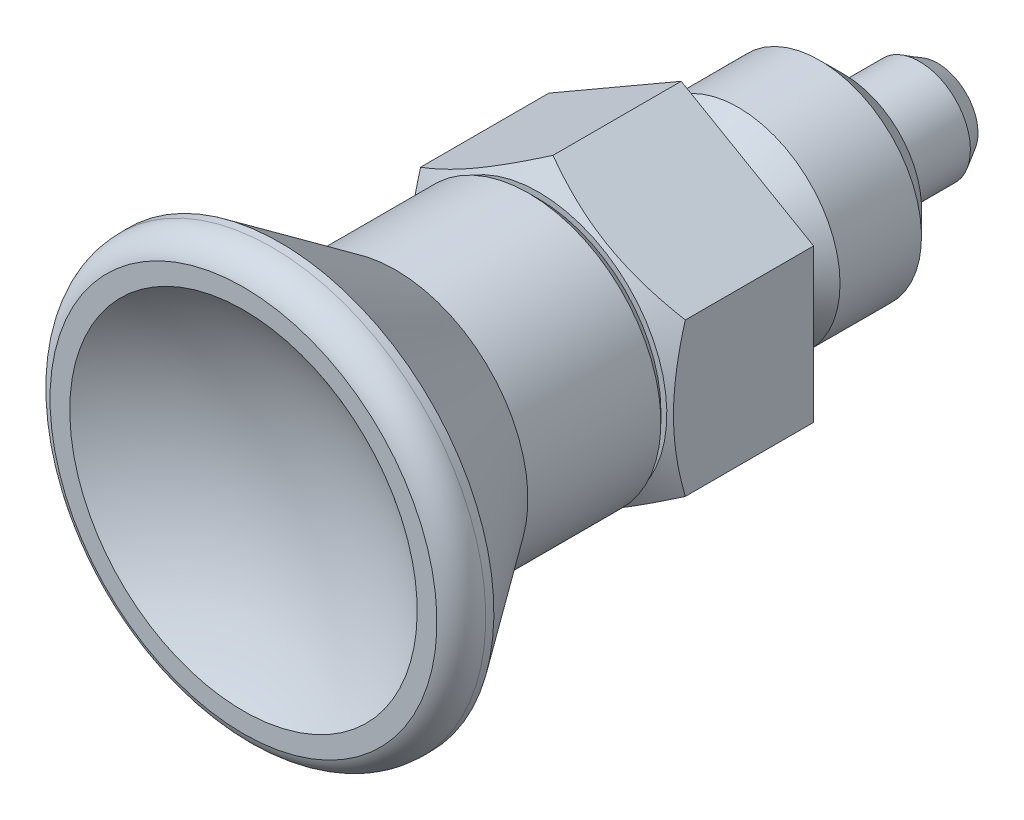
ISO-10303-21;
HEADER;
FILE_DESCRIPTION(('STEP AP214'),'2;1');
FILE_NAME('part.step','',(''),(''),'','','');
FILE_SCHEMA(('AUTOMOTIVE_DESIGN { 1 0 10303 214 1 1 1 1 }'));
ENDSEC;
DATA;
#1=APPLICATION_CONTEXT('core data for automotive mechanical design processes');
#2=APPLICATION_PROTOCOL_DEFINITION('international standard','automotive_design',2000,#1);
#3=PRODUCT_CONTEXT('',#1,'mechanical');
#4=PRODUCT('Part','Part','',(#3));
#5=PRODUCT_RELATED_PRODUCT_CATEGORY('part','',(#4));
#6=PRODUCT_DEFINITION_FORMATION('','',#4);
#7=PRODUCT_DEFINITION_CONTEXT('part definition',#1,'design');
#8=PRODUCT_DEFINITION('design','',#6,#7);
#9=PRODUCT_DEFINITION_SHAPE('','',#8);
#10=(LENGTH_UNIT() NAMED_UNIT(*) SI_UNIT(.MILLI.,.METRE.));
#11=(NAMED_UNIT(*) PLANE_ANGLE_UNIT() SI_UNIT($,.RADIAN.));
#12=(NAMED_UNIT(*) SI_UNIT($,.STERADIAN.) SOLID_ANGLE_UNIT());
#13=UNCERTAINTY_MEASURE_WITH_UNIT(LENGTH_MEASURE(1.E-05),#10,'distance_accuracy_value','');
#14=(GEOMETRIC_REPRESENTATION_CONTEXT(3) GLOBAL_UNCERTAINTY_ASSIGNED_CONTEXT((#13)) GLOBAL_UNIT_ASSIGNED_CONTEXT((#10,
#11,#12)) REPRESENTATION_CONTEXT('',''));
#15=CARTESIAN_POINT('',(0.,0.,0.));
#16=DIRECTION('',(0.,0.,1.));
#17=DIRECTION('',(1.,0.,0.));
#18=AXIS2_PLACEMENT_3D('',#15,#16,#17);
#19=CARTESIAN_POINT('',(0.,0.,-8.0000000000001));
#20=DIRECTION('',(-1.,0.,0.));
#21=DIRECTION('',(0.,1.,0.));
#22=AXIS2_PLACEMENT_3D('',#19,#20,#21);
#23=SPHERICAL_SURFACE('',#22,4.99999999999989);
#24=CARTESIAN_POINT('',(0.,0.,-12.5881225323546));
#25=DIRECTION('',(0.,0.,1.));
#26=DIRECTION('',(0.,-1.,0.));
#27=AXIS2_PLACEMENT_3D('',#24,#25,#26);
#28=CIRCLE('',#27,1.98724221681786);
#29=CARTESIAN_POINT('',(0.,-1.98724221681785,-12.5881225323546));
#30=VERTEX_POINT('',#29);
#31=EDGE_CURVE('E18',#30,#30,#28,.T.);
#32=ORIENTED_EDGE('',*,*,#31,.F.);
#33=EDGE_LOOP('',(#32));
#34=FACE_BOUND('',#33,.T.);
#35=ADVANCED_FACE('F14',(#34),#23,.T.);
#36=CARTESIAN_POINT('',(0.,0.,-11.7000000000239));
#37=DIRECTION('',(0.,0.,1.));
#38=DIRECTION('',(0.,-1.,0.));
#39=AXIS2_PLACEMENT_3D('',#36,#37,#38);
#40=CONICAL_SURFACE('',#39,2.49999999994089,0.523598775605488);
#41=CARTESIAN_POINT('',(0.,0.,-11.7));
#42=DIRECTION('',(0.,0.,1.));
#43=DIRECTION('',(0.,-1.,0.));
#44=AXIS2_PLACEMENT_3D('',#41,#42,#43);
#45=CIRCLE('',#44,2.5);
#46=CARTESIAN_POINT('',(0.,-2.5,-11.7));
#47=VERTEX_POINT('',#46);
#48=EDGE_CURVE('E266',#47,#47,#45,.T.);
#49=ORIENTED_EDGE('',*,*,#48,.F.);
#50=EDGE_LOOP('',(#49));
#51=FACE_BOUND('',#50,.T.);
#52=ORIENTED_EDGE('',*,*,#31,.T.);
#53=EDGE_LOOP('',(#52));
#54=FACE_BOUND('',#53,.T.);
#55=ADVANCED_FACE('F177',(#51,#54),#40,.T.);
#56=CARTESIAN_POINT('',(0.,0.,-13.));
#57=DIRECTION('',(0.,0.,1.));
#58=DIRECTION('',(0.,-1.,0.));
#59=AXIS2_PLACEMENT_3D('',#56,#57,#58);
#60=CYLINDRICAL_SURFACE('',#59,2.5);
#61=CARTESIAN_POINT('',(0.,0.,-8.));
#62=DIRECTION('',(0.,0.,1.));
#63=DIRECTION('',(0.,-1.,0.));
#64=AXIS2_PLACEMENT_3D('',#61,#62,#63);
#65=CIRCLE('',#64,2.5);
#66=CARTESIAN_POINT('',(0.,-2.5,-8.));
#67=VERTEX_POINT('',#66);
#68=EDGE_CURVE('E269',#67,#67,#65,.F.);
#69=ORIENTED_EDGE('',*,*,#68,.T.);
#70=EDGE_LOOP('',(#69));
#71=FACE_BOUND('',#70,.T.);
#72=ORIENTED_EDGE('',*,*,#48,.T.);
#73=EDGE_LOOP('',(#72));
#74=FACE_BOUND('',#73,.T.);
#75=ADVANCED_FACE('F174',(#71,#74),#60,.T.);
#76=CARTESIAN_POINT('',(3.8,0.,-8.));
#77=DIRECTION('',(0.,0.,1.));
#78=DIRECTION('',(0.,-1.,0.));
#79=AXIS2_PLACEMENT_3D('',#76,#77,#78);
#80=PLANE('',#79);
#81=CARTESIAN_POINT('',(0.,0.,-8.0000000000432));
#82=DIRECTION('',(0.,0.,1.));
#83=DIRECTION('',(-1.,0.,0.));
#84=AXIS2_PLACEMENT_3D('',#81,#82,#83);
#85=CIRCLE('',#84,3.79999999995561);
#86=CARTESIAN_POINT('',(-3.79999999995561,0.,-8.0000000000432));
#87=VERTEX_POINT('',#86);
#88=EDGE_CURVE('E276',#87,#87,#85,.T.);
#89=ORIENTED_EDGE('',*,*,#88,.F.);
#90=EDGE_LOOP('',(#89));
#91=FACE_BOUND('',#90,.T.);
#92=ORIENTED_EDGE('',*,*,#68,.F.);
#93=EDGE_LOOP('',(#92));
#94=FACE_BOUND('',#93,.T.);
#95=ADVANCED_FACE('F170',(#91,#94),#80,.F.);
#96=CARTESIAN_POINT('',(0.,0.,-6.80000000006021));
#97=DIRECTION('',(0.,0.,1.));
#98=DIRECTION('',(-1.,0.,0.));
#99=AXIS2_PLACEMENT_3D('',#96,#97,#98);
#100=CONICAL_SURFACE('',#99,4.99999999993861,0.785398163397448);
#101=CARTESIAN_POINT('',(0.,0.,-6.8));
#102=DIRECTION('',(0.,0.,1.));
#103=DIRECTION('',(0.,-1.,0.));
#104=AXIS2_PLACEMENT_3D('',#101,#102,#103);
#105=CIRCLE('',#104,5.);
#106=CARTESIAN_POINT('',(0.,-5.,-6.8));
#107=VERTEX_POINT('',#106);
#108=EDGE_CURVE('E272',#107,#107,#105,.T.);
#109=ORIENTED_EDGE('',*,*,#108,.F.);
#110=EDGE_LOOP('',(#109));
#111=FACE_BOUND('',#110,.T.);
#112=ORIENTED_EDGE('',*,*,#88,.T.);
#113=EDGE_LOOP('',(#112));
#114=FACE_BOUND('',#113,.T.);
#115=ADVANCED_FACE('F166',(#111,#114),#100,.T.);
#116=CARTESIAN_POINT('',(0.,0.,-8.));
#117=DIRECTION('',(0.,0.,1.));
#118=DIRECTION('',(0.,-1.,0.));
#119=AXIS2_PLACEMENT_3D('',#116,#117,#118);
#120=CYLINDRICAL_SURFACE('',#119,5.);
#121=CARTESIAN_POINT('',(0.,0.,-2.79999999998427));
#122=DIRECTION('',(0.,0.,-1.));
#123=DIRECTION('',(0.,1.,0.));
#124=AXIS2_PLACEMENT_3D('',#121,#122,#123);
#125=CIRCLE('',#124,4.99999999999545);
#126=CARTESIAN_POINT('',(0.,4.99999999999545,-2.79999999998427));
#127=VERTEX_POINT('',#126);
#128=EDGE_CURVE('E275',#127,#127,#125,.F.);
#129=ORIENTED_EDGE('',*,*,#128,.F.);
#130=EDGE_LOOP('',(#129));
#131=FACE_BOUND('',#130,.T.);
#132=ORIENTED_EDGE('',*,*,#108,.T.);
#133=EDGE_LOOP('',(#132));
#134=FACE_BOUND('',#133,.T.);
#135=ADVANCED_FACE('F162',(#131,#134),#120,.T.);
#136=CARTESIAN_POINT('',(0.,0.,-2.79999999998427));
#137=DIRECTION('',(0.,0.,-1.));
#138=DIRECTION('',(0.,1.,0.));
#139=AXIS2_PLACEMENT_3D('',#136,#137,#138);
#140=CONICAL_SURFACE('',#139,4.99999999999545,0.698131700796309);
#141=CARTESIAN_POINT('',(0.,0.,-1.29883539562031));
#142=DIRECTION('',(0.,0.,-1.));
#143=DIRECTION('',(0.,1.,0.));
#144=AXIS2_PLACEMENT_3D('',#141,#142,#143);
#145=CIRCLE('',#144,3.74037333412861);
#146=CARTESIAN_POINT('',(0.,3.74037333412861,-1.29883539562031));
#147=VERTEX_POINT('',#146);
#148=EDGE_CURVE('E149',#147,#147,#145,.T.);
#149=ORIENTED_EDGE('',*,*,#148,.T.);
#150=EDGE_LOOP('',(#149));
#151=FACE_BOUND('',#150,.T.);
#152=ORIENTED_EDGE('',*,*,#128,.T.);
#153=EDGE_LOOP('',(#152));
#154=FACE_BOUND('',#153,.T.);
#155=ADVANCED_FACE('F158',(#151,#154),#140,.T.);
#156=CARTESIAN_POINT('',(0.,0.,-0.91316282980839));
#157=DIRECTION('',(0.,0.,-1.));
#158=DIRECTION('',(0.,1.,0.));
#159=AXIS2_PLACEMENT_3D('',#156,#157,#158);
#160=TOROIDAL_SURFACE('',#159,4.2,0.6);
#161=CARTESIAN_POINT('',(0.,0.,-0.91316282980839));
#162=DIRECTION('',(0.,0.,1.));
#163=DIRECTION('',(0.,-1.,0.));
#164=AXIS2_PLACEMENT_3D('',#161,#162,#163);
#165=CIRCLE('',#164,3.6);
#166=CARTESIAN_POINT('',(0.,-3.6,-0.91316282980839));
#167=VERTEX_POINT('',#166);
#168=EDGE_CURVE('E136',#167,#167,#165,.T.);
#169=ORIENTED_EDGE('',*,*,#168,.F.);
#170=EDGE_LOOP('',(#169));
#171=FACE_BOUND('',#170,.T.);
#172=ORIENTED_EDGE('',*,*,#148,.F.);
#173=EDGE_LOOP('',(#172));
#174=FACE_BOUND('',#173,.T.);
#175=ADVANCED_FACE('F155',(#171,#174),#160,.F.);
#176=CARTESIAN_POINT('',(0.,0.,-8.));
#177=DIRECTION('',(0.,0.,1.));
#178=DIRECTION('',(0.,-1.,0.));
#179=AXIS2_PLACEMENT_3D('',#176,#177,#178);
#180=CYLINDRICAL_SURFACE('',#179,3.6);
#181=CARTESIAN_POINT('',(0.,0.,-0.6));
#182=DIRECTION('',(0.,0.,-1.));
#183=DIRECTION('',(0.,1.,0.));
#184=AXIS2_PLACEMENT_3D('',#181,#182,#183);
#185=CIRCLE('',#184,3.6);
#186=CARTESIAN_POINT('',(0.,3.6,-0.6));
#187=VERTEX_POINT('',#186);
#188=EDGE_CURVE('E133',#187,#187,#185,.T.);
#189=ORIENTED_EDGE('',*,*,#188,.T.);
#190=EDGE_LOOP('',(#189));
#191=FACE_BOUND('',#190,.T.);
#192=ORIENTED_EDGE('',*,*,#168,.T.);
#193=EDGE_LOOP('',(#192));
#194=FACE_BOUND('',#193,.T.);
#195=ADVANCED_FACE('F126',(#191,#194),#180,.T.);
#196=CARTESIAN_POINT('',(0.,0.,-0.6));
#197=DIRECTION('',(0.,0.,-1.));
#198=DIRECTION('',(0.,1.,0.));
#199=AXIS2_PLACEMENT_3D('',#196,#197,#198);
#200=TOROIDAL_SURFACE('',#199,4.2,0.6);
#201=CARTESIAN_POINT('',(0.,0.,0.));
#202=DIRECTION('',(0.,0.,-1.));
#203=DIRECTION('',(0.,1.,0.));
#204=AXIS2_PLACEMENT_3D('',#201,#202,#203);
#205=CIRCLE('',#204,4.2);
#206=CARTESIAN_POINT('',(0.,4.2,0.));
#207=VERTEX_POINT('',#206);
#208=EDGE_CURVE('E81',#207,#207,#205,.T.);
#209=ORIENTED_EDGE('',*,*,#208,.T.);
#210=EDGE_LOOP('',(#209));
#211=FACE_BOUND('',#210,.T.);
#212=ORIENTED_EDGE('',*,*,#188,.F.);
#213=EDGE_LOOP('',(#212));
#214=FACE_BOUND('',#213,.T.);
#215=ADVANCED_FACE('F119',(#211,#214),#200,.F.);
#216=CARTESIAN_POINT('',(18.,0.,0.));
#217=DIRECTION('',(0.,0.,1.));
#218=DIRECTION('',(0.,-1.,0.));
#219=AXIS2_PLACEMENT_3D('',#216,#217,#218);
#220=PLANE('',#219);
#221=DIRECTION('',(-0.866025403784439,0.5,0.));
#222=VECTOR('',#221,1.);
#223=CARTESIAN_POINT('',(6.5,3.75277674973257,0.));
#224=LINE('',#223,#222);
#225=CARTESIAN_POINT('',(6.5,3.75277674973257,0.));
#226=VERTEX_POINT('',#225);
#227=CARTESIAN_POINT('',(0.,7.50555349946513,0.));
#228=VERTEX_POINT('',#227);
#229=EDGE_CURVE('E88',#226,#228,#224,.T.);
#230=ORIENTED_EDGE('',*,*,#229,.F.);
#231=DIRECTION('',(0.,1.,0.));
#232=VECTOR('',#231,1.);
#233=CARTESIAN_POINT('',(6.5,-3.75277674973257,0.));
#234=LINE('',#233,#232);
#235=CARTESIAN_POINT('',(6.5,-3.75277674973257,0.));
#236=VERTEX_POINT('',#235);
#237=EDGE_CURVE('E84',#236,#226,#234,.T.);
#238=ORIENTED_EDGE('',*,*,#237,.F.);
#239=DIRECTION('',(0.866025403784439,0.5,0.));
#240=VECTOR('',#239,1.);
#241=CARTESIAN_POINT('',(0.,-7.50555349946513,0.));
#242=LINE('',#241,#240);
#243=CARTESIAN_POINT('',(0.,-7.50555349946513,0.));
#244=VERTEX_POINT('',#243);
#245=EDGE_CURVE('E60',#244,#236,#242,.T.);
#246=ORIENTED_EDGE('',*,*,#245,.F.);
#247=DIRECTION('',(0.866025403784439,-0.5,0.));
#248=VECTOR('',#247,1.);
#249=CARTESIAN_POINT('',(-6.5,-3.75277674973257,0.));
#250=LINE('',#249,#248);
#251=CARTESIAN_POINT('',(-6.5,-3.75277674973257,0.));
#252=VERTEX_POINT('',#251);
#253=EDGE_CURVE('E100',#252,#244,#250,.T.);
#254=ORIENTED_EDGE('',*,*,#253,.F.);
#255=DIRECTION('',(0.,-1.,0.));
#256=VECTOR('',#255,1.);
#257=CARTESIAN_POINT('',(-6.5,3.75277674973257,0.));
#258=LINE('',#257,#256);
#259=CARTESIAN_POINT('',(-6.5,3.75277674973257,0.));
#260=VERTEX_POINT('',#259);
#261=EDGE_CURVE('E65',#260,#252,#258,.T.);
#262=ORIENTED_EDGE('',*,*,#261,.F.);
#263=DIRECTION('',(-0.866025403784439,-0.5,0.));
#264=VECTOR('',#263,1.);
#265=CARTESIAN_POINT('',(0.,7.50555349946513,0.));
#266=LINE('',#265,#264);
#267=EDGE_CURVE('E353',#228,#260,#266,.T.);
#268=ORIENTED_EDGE('',*,*,#267,.F.);
#269=EDGE_LOOP('',(#230,#238,#246,#254,#262,#268));
#270=FACE_BOUND('',#269,.T.);
#271=ORIENTED_EDGE('',*,*,#208,.F.);
#272=EDGE_LOOP('',(#271));
#273=FACE_BOUND('',#272,.T.);
#274=ADVANCED_FACE('F85',(#270,#273),#220,.F.);
#275=CARTESIAN_POINT('',(0.,-7.50555349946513,0.));
#276=DIRECTION('',(0.5,-0.866025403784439,0.));
#277=DIRECTION('',(0.866025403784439,0.5,0.));
#278=AXIS2_PLACEMENT_3D('',#275,#276,#277);
#279=PLANE('',#278);
#280=ORIENTED_EDGE('',*,*,#245,.T.);
#281=DIRECTION('',(0.,0.,1.));
#282=VECTOR('',#281,1.);
#283=CARTESIAN_POINT('',(6.5,-3.75277674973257,0.));
#284=LINE('',#283,#282);
#285=CARTESIAN_POINT('',(6.5,-3.75277676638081,6.29999999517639));
#286=VERTEX_POINT('',#285);
#287=EDGE_CURVE('E77',#286,#236,#284,.F.);
#288=ORIENTED_EDGE('',*,*,#287,.F.);
#289=CARTESIAN_POINT('',(7.50268835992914E-08,-7.50555345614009,6.3000000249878));
#290=CARTESIAN_POINT('',(0.142875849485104,-7.42306408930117,6.34761609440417));
#291=CARTESIAN_POINT('',(0.286284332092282,-7.34026716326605,6.39307099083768));
#292=CARTESIAN_POINT('',(0.574265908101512,-7.17400092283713,6.47906323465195));
#293=CARTESIAN_POINT('',(0.718839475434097,-7.09053133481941,6.51959846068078));
#294=CARTESIAN_POINT('',(1.15487481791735,-6.83878621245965,6.6330289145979));
#295=CARTESIAN_POINT('',(1.44805771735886,-6.66951698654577,6.69754584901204));
#296=CARTESIAN_POINT('',(1.88680055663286,-6.41620869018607,6.77319774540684));
#297=CARTESIAN_POINT('',(2.03104970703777,-6.33292640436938,6.79474842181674));
#298=CARTESIAN_POINT('',(2.32019970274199,-6.16598557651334,6.83088489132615));
#299=CARTESIAN_POINT('',(2.4651004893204,-6.08232706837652,6.84547129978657));
#300=CARTESIAN_POINT('',(2.75515364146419,-5.914864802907,6.86730749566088));
#301=CARTESIAN_POINT('',(2.90030553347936,-5.83106131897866,6.87456560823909));
#302=CARTESIAN_POINT('',(3.19073528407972,-5.66338162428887,6.88159737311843));
#303=CARTESIAN_POINT('',(3.33601313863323,-5.57950541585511,6.88137125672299));
#304=CARTESIAN_POINT('',(3.73400213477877,-5.34972636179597,6.87046502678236));
#305=CARTESIAN_POINT('',(3.98658292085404,-5.20389877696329,6.85216555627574));
#306=CARTESIAN_POINT('',(4.49006691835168,-4.91321215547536,6.79414403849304));
#307=CARTESIAN_POINT('',(4.7409683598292,-4.76835414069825,6.75440217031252));
#308=CARTESIAN_POINT('',(5.24546515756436,-4.47708277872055,6.65506149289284));
#309=CARTESIAN_POINT('',(5.49899687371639,-4.33070617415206,6.59504189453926));
#310=CARTESIAN_POINT('',(6.00227998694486,-4.04013553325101,6.45882256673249));
#311=CARTESIAN_POINT('',(6.25203782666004,-3.89593777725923,6.38265482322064));
#312=CARTESIAN_POINT('',(6.49999992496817,-3.75277679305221,6.30000002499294));
#313=B_SPLINE_CURVE_WITH_KNOTS('',3,(#289,#290,#291,#292,#293,#294,#295,#296,#297,#298,#299,
#300,#301,#302,#303,#304,#305,#306,#307,#308,#309,#310,#311,#312),.UNSPECIFIED.,.F.,.F.,(4,2,2,
2,2,2,2,2,2,2,2,4),(0.,0.515097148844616,1.03041562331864,2.06319348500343,2.56693467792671,
3.07063135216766,3.57375516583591,4.07686343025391,4.95263079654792,5.82920909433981,
6.72522569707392,7.61948379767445),.UNSPECIFIED.);
#314=CARTESIAN_POINT('',(3.75146884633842E-08,-7.50555347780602,6.30000001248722));
#315=VERTEX_POINT('',#314);
#316=EDGE_CURVE('E52',#315,#286,#313,.T.);
#317=ORIENTED_EDGE('',*,*,#316,.F.);
#318=DIRECTION('',(0.,0.,1.));
#319=VECTOR('',#318,1.);
#320=CARTESIAN_POINT('',(0.,-7.50555349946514,0.));
#321=LINE('',#320,#319);
#322=EDGE_CURVE('E79',#244,#315,#321,.T.);
#323=ORIENTED_EDGE('',*,*,#322,.F.);
#324=EDGE_LOOP('',(#280,#288,#317,#323));
#325=FACE_BOUND('',#324,.T.);
#326=ADVANCED_FACE('F75',(#325),#279,.T.);
#327=CARTESIAN_POINT('',(6.5,-3.75277674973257,0.));
#328=DIRECTION('',(1.,0.,0.));
#329=DIRECTION('',(0.,1.,0.));
#330=AXIS2_PLACEMENT_3D('',#327,#328,#329);
#331=PLANE('',#330);
#332=ORIENTED_EDGE('',*,*,#237,.T.);
#333=DIRECTION('',(0.,0.,1.));
#334=VECTOR('',#333,1.);
#335=CARTESIAN_POINT('',(6.5,3.75277674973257,0.));
#336=LINE('',#335,#334);
#337=CARTESIAN_POINT('',(6.50000001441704,3.75277674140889,6.29999999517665));
#338=VERTEX_POINT('',#337);
#339=EDGE_CURVE('E91',#338,#226,#336,.F.);
#340=ORIENTED_EDGE('',*,*,#339,.F.);
#341=CARTESIAN_POINT('',(6.49999996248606,-3.75277677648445,6.29999996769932));
#342=CARTESIAN_POINT('',(6.49999998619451,-3.58779804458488,6.34761605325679));
#343=CARTESIAN_POINT('',(6.49999999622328,-3.42220419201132,6.39307095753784));
#344=CARTESIAN_POINT('',(6.50000000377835,-3.08967170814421,6.47906320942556));
#345=CARTESIAN_POINT('',(6.50000000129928,-2.92273252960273,6.51959843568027));
#346=CARTESIAN_POINT('',(6.49999999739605,-2.41924227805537,6.63302889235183));
#347=CARTESIAN_POINT('',(6.49999999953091,-2.08070382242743,6.69754583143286));
#348=CARTESIAN_POINT('',(6.5000000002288,-1.5740872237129,6.77319773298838));
#349=CARTESIAN_POINT('',(6.50000000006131,-1.40752265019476,6.79474841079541));
#350=CARTESIAN_POINT('',(6.4999999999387,-1.07364099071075,6.8308848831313));
#351=CARTESIAN_POINT('',(6.49999999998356,-0.906323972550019,6.84547129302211));
#352=CARTESIAN_POINT('',(6.50000000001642,-0.571399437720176,6.86730749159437));
#353=CARTESIAN_POINT('',(6.50000000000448,-0.403792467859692,6.87456560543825));
#354=CARTESIAN_POINT('',(6.49999999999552,-0.0684330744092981,6.88159737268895));
#355=CARTESIAN_POINT('',(6.4999999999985,0.0993193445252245,6.88137125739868));
#356=CARTESIAN_POINT('',(6.5000000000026,0.558877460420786,6.8704650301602));
#357=CARTESIAN_POINT('',(6.5000000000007,0.850532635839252,6.85216556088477));
#358=CARTESIAN_POINT('',(6.4999999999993,1.43190589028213,6.79414404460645));
#359=CARTESIAN_POINT('',(6.4999999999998,1.72162192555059,6.7544021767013));
#360=CARTESIAN_POINT('',(6.50000000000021,2.30416466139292,6.65506149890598));
#361=CARTESIAN_POINT('',(6.5000000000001,2.59691787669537,6.59504189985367));
#362=CARTESIAN_POINT('',(6.4999999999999,3.17805917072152,6.45882256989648));
#363=CARTESIAN_POINT('',(6.49999999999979,3.4664546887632,6.38265482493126));
#364=CARTESIAN_POINT('',(6.5,3.7527766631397,6.30000002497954));
#365=B_SPLINE_CURVE_WITH_KNOTS('',3,(#341,#342,#343,#344,#345,#346,#347,#348,#349,#350,#351,
#352,#353,#354,#355,#356,#357,#358,#359,#360,#361,#362,#363,#364),.UNSPECIFIED.,.F.,.F.,(4,2,2,
2,2,2,2,2,2,2,2,4),(0.,0.515097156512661,1.03041563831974,2.06319351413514,2.56693471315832,
3.07063139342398,3.57375521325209,4.07686348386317,4.95263086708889,5.82920918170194,
6.72522580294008,7.6194839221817),.UNSPECIFIED.);
#366=EDGE_CURVE('E95',#286,#338,#365,.T.);
#367=ORIENTED_EDGE('',*,*,#366,.F.);
#368=ORIENTED_EDGE('',*,*,#287,.T.);
#369=EDGE_LOOP('',(#332,#340,#367,#368));
#370=FACE_BOUND('',#369,.T.);
#371=ADVANCED_FACE('F93',(#370),#331,.T.);
#372=CARTESIAN_POINT('',(6.5,3.75277674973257,0.));
#373=DIRECTION('',(0.5,0.866025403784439,0.));
#374=DIRECTION('',(-0.866025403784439,0.5,0.));
#375=AXIS2_PLACEMENT_3D('',#372,#373,#374);
#376=PLANE('',#375);
#377=ORIENTED_EDGE('',*,*,#229,.T.);
#378=DIRECTION('',(0.,0.,1.));
#379=VECTOR('',#378,1.);
#380=CARTESIAN_POINT('',(0.,7.50555349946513,0.));
#381=LINE('',#380,#379);
#382=CARTESIAN_POINT('',(-1.15488270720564E-08,7.50555349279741,6.30000000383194));
#383=VERTEX_POINT('',#382);
#384=EDGE_CURVE('E358',#383,#228,#381,.F.);
#385=ORIENTED_EDGE('',*,*,#384,.F.);
#386=CARTESIAN_POINT('',(6.5000000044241,3.75277670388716,6.29999996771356));
#387=CARTESIAN_POINT('',(6.35712424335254,3.83526609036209,6.34761605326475));
#388=CARTESIAN_POINT('',(6.21371576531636,3.91806302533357,6.39307095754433));
#389=CARTESIAN_POINT('',(5.92573419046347,4.0843292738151,6.47906320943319));
#390=CARTESIAN_POINT('',(5.78116061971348,4.16779886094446,6.5195984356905));
#391=CARTESIAN_POINT('',(5.34512526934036,4.41954398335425,6.63302889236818));
#392=CARTESIAN_POINT('',(5.05194236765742,4.58881321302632,6.69754583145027));
#393=CARTESIAN_POINT('',(4.61319952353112,4.84212151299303,6.77319773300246));
#394=CARTESIAN_POINT('',(4.46895037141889,4.92540379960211,6.79474841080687));
#395=CARTESIAN_POINT('',(4.17980037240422,5.09234462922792,6.83088488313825));
#396=CARTESIAN_POINT('',(4.03489958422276,5.17600313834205,6.84547129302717));
#397=CARTESIAN_POINT('',(3.74484642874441,5.34346540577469,6.86730749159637));
#398=CARTESIAN_POINT('',(3.59969453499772,5.42726889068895,6.87456560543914));
#399=CARTESIAN_POINT('',(3.30926478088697,5.59494858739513,6.88159737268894));
#400=CARTESIAN_POINT('',(3.16398692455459,5.67882479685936,6.88137125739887));
#401=CARTESIAN_POINT('',(2.76599791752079,5.90860385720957,6.87046503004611));
#402=CARTESIAN_POINT('',(2.513417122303,6.0544314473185,6.85216556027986));
#403=CARTESIAN_POINT('',(2.0099331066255,6.34511807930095,6.79414404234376));
#404=CARTESIAN_POINT('',(1.75903165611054,6.48997609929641,6.75440217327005));
#405=CARTESIAN_POINT('',(1.2545348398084,6.78124747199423,6.6550614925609));
#406=CARTESIAN_POINT('',(1.00100311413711,6.92762408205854,6.59504189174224));
#407=CARTESIAN_POINT('',(0.49771998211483,7.21819473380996,6.45882255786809));
#408=CARTESIAN_POINT('',(0.247962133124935,7.36239249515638,6.38265481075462));
#409=CARTESIAN_POINT('',(2.56817182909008E-08,7.50555348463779,6.3000000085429));
#410=B_SPLINE_CURVE_WITH_KNOTS('',3,(#386,#387,#388,#389,#390,#391,#392,#393,#394,#395,#396,
#397,#398,#399,#400,#401,#402,#403,#404,#405,#406,#407,#408,#409),.UNSPECIFIED.,.F.,.F.,(4,2,2,
2,2,2,2,2,2,2,2,4),(0.,0.515097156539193,1.03041563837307,2.06319351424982,2.56693471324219,
3.07063139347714,3.57375521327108,4.07686348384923,4.95263088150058,5.82920921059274,
6.7252258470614,7.61948398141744),.UNSPECIFIED.);
#411=EDGE_CURVE('E304',#338,#383,#410,.T.);
#412=ORIENTED_EDGE('',*,*,#411,.F.);
#413=ORIENTED_EDGE('',*,*,#339,.T.);
#414=EDGE_LOOP('',(#377,#385,#412,#413));
#415=FACE_BOUND('',#414,.T.);
#416=ADVANCED_FACE('F313',(#415),#376,.T.);
#417=CARTESIAN_POINT('',(0.,7.50555349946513,0.));
#418=DIRECTION('',(-0.5,0.866025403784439,0.));
#419=DIRECTION('',(-0.866025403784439,-0.5,0.));
#420=AXIS2_PLACEMENT_3D('',#417,#418,#419);
#421=PLANE('',#420);
#422=ORIENTED_EDGE('',*,*,#267,.T.);
#423=DIRECTION('',(0.,0.,1.));
#424=VECTOR('',#423,1.);
#425=CARTESIAN_POINT('',(-6.5,3.75277674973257,0.));
#426=LINE('',#425,#424);
#427=CARTESIAN_POINT('',(-6.5,3.75277676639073,6.29999999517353));
#428=VERTEX_POINT('',#427);
#429=EDGE_CURVE('E355',#428,#260,#426,.F.);
#430=ORIENTED_EDGE('',*,*,#429,.F.);
#431=CARTESIAN_POINT('',(-1.65519125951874E-08,7.50555346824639,6.29999999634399));
#432=CARTESIAN_POINT('',(-0.142875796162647,7.42306411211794,6.34761607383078));
#433=CARTESIAN_POINT('',(-0.286284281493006,7.34026719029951,6.393070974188));
#434=CARTESIAN_POINT('',(-0.574265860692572,7.17400095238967,6.47906322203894));
#435=CARTESIAN_POINT('',(-0.718839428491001,7.090531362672,6.51959844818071));
#436=CARTESIAN_POINT('',(-1.15487477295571,6.83878623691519,6.63302890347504));
#437=CARTESIAN_POINT('',(-1.44805767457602,6.66951701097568,6.69754584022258));
#438=CARTESIAN_POINT('',(-1.88680051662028,6.41620871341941,6.7731977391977));
#439=CARTESIAN_POINT('',(-2.03104966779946,6.33292642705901,6.79474841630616));
#440=CARTESIAN_POINT('',(-2.32019966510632,6.16598559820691,6.83088488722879));
#441=CARTESIAN_POINT('',(-2.46510045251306,6.08232708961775,6.84547129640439));
#442=CARTESIAN_POINT('',(-2.75515360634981,5.91486482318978,6.86730749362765));
#443=CARTESIAN_POINT('',(-2.90030549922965,5.83106133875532,6.87456560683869));
#444=CARTESIAN_POINT('',(-3.19073525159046,5.66338164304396,6.88159737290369));
#445=CARTESIAN_POINT('',(-3.33601310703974,5.57950543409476,6.88137125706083));
#446=CARTESIAN_POINT('',(-3.73400210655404,5.34972637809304,6.87046502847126));
#447=CARTESIAN_POINT('',(-3.98658289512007,5.2038987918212,6.85216555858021));
#448=CARTESIAN_POINT('',(-4.49006689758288,4.91321216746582,6.79414404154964));
#449=CARTESIAN_POINT('',(-4.74096834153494,4.76835415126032,6.75440217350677));
#450=CARTESIAN_POINT('',(-5.24546514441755,4.47708278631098,6.65506149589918));
#451=CARTESIAN_POINT('',(-5.49899686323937,4.33070618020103,6.5950418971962));
#452=CARTESIAN_POINT('',(-6.00227998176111,4.04013553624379,6.45882256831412));
#453=CARTESIAN_POINT('',(-6.25203782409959,3.89593777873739,6.38265482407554));
#454=CARTESIAN_POINT('',(-6.49999992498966,3.7527767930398,6.30000002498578));
#455=B_SPLINE_CURVE_WITH_KNOTS('',3,(#431,#432,#433,#434,#435,#436,#437,#438,#439,#440,#441,
#442,#443,#444,#445,#446,#447,#448,#449,#450,#451,#452,#453,#454),.UNSPECIFIED.,.F.,.F.,(4,2,2,
2,2,2,2,2,2,2,2,4),(0.,0.515097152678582,1.03041563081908,2.06319349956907,2.56693469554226,
3.07063137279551,3.57375518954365,4.07686345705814,4.95263083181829,5.82920913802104,
6.72522575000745,7.61948385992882),.UNSPECIFIED.);
#456=EDGE_CURVE('E325',#383,#428,#455,.T.);
#457=ORIENTED_EDGE('',*,*,#456,.F.);
#458=ORIENTED_EDGE('',*,*,#384,.T.);
#459=EDGE_LOOP('',(#422,#430,#457,#458));
#460=FACE_BOUND('',#459,.T.);
#461=ADVANCED_FACE('F317',(#460),#421,.T.);
#462=CARTESIAN_POINT('',(-6.5,3.75277674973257,0.));
#463=DIRECTION('',(-1.,0.,0.));
#464=DIRECTION('',(0.,-1.,0.));
#465=AXIS2_PLACEMENT_3D('',#462,#463,#464);
#466=PLANE('',#465);
#467=ORIENTED_EDGE('',*,*,#261,.T.);
#468=DIRECTION('',(0.,0.,1.));
#469=VECTOR('',#468,1.);
#470=CARTESIAN_POINT('',(-6.5,-3.75277674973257,0.));
#471=LINE('',#470,#469);
#472=CARTESIAN_POINT('',(-6.50000001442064,-3.75277674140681,6.29999999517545));
#473=VERTEX_POINT('',#472);
#474=EDGE_CURVE('E33',#473,#252,#471,.F.);
#475=ORIENTED_EDGE('',*,*,#474,.F.);
#476=CARTESIAN_POINT('',(-6.49999996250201,3.75277677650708,6.29999996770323));
#477=CARTESIAN_POINT('',(-6.49999998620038,3.58779804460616,6.34761605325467));
#478=CARTESIAN_POINT('',(-6.49999999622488,3.42220419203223,6.39307095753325));
#479=CARTESIAN_POINT('',(-6.50000000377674,3.08967170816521,6.4790632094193));
#480=CARTESIAN_POINT('',(-6.50000000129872,2.9227325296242,6.51959843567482));
#481=CARTESIAN_POINT('',(-6.49999999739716,2.41924227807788,6.63302889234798));
#482=CARTESIAN_POINT('',(-6.49999999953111,2.08070382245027,6.69754583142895));
#483=CARTESIAN_POINT('',(-6.5000000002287,1.57408722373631,6.77319773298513));
#484=CARTESIAN_POINT('',(-6.50000000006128,1.40752265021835,6.7947484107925));
#485=CARTESIAN_POINT('',(-6.49999999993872,1.07364099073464,6.83088488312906));
#486=CARTESIAN_POINT('',(-6.49999999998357,0.906323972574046,6.84547129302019));
#487=CARTESIAN_POINT('',(-6.50000000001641,0.571399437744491,6.86730749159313));
#488=CARTESIAN_POINT('',(-6.50000000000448,0.403792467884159,6.87456560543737));
#489=CARTESIAN_POINT('',(-6.49999999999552,0.0684330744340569,6.88159737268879));
#490=CARTESIAN_POINT('',(-6.4999999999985,-0.0993193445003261,6.88137125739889));
#491=CARTESIAN_POINT('',(-6.5000000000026,-0.55887746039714,6.8704650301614));
#492=CARTESIAN_POINT('',(-6.5000000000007,-0.850532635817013,6.85216556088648));
#493=CARTESIAN_POINT('',(-6.4999999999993,-1.43190589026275,6.7941440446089));
#494=CARTESIAN_POINT('',(-6.4999999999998,-1.72162192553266,6.75440217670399));
#495=CARTESIAN_POINT('',(-6.50000000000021,-2.30416466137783,6.65506149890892));
#496=CARTESIAN_POINT('',(-6.5000000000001,-2.59691787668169,6.59504189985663));
#497=CARTESIAN_POINT('',(-6.4999999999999,-3.17805917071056,6.45882256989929));
#498=CARTESIAN_POINT('',(-6.49999999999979,-3.46645468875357,6.3826548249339));
#499=CARTESIAN_POINT('',(-6.5,-3.75277666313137,6.30000002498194));
#500=B_SPLINE_CURVE_WITH_KNOTS('',3,(#476,#477,#478,#479,#480,#481,#482,#483,#484,#485,#486,
#487,#488,#489,#490,#491,#492,#493,#494,#495,#496,#497,#498,#499),.UNSPECIFIED.,.F.,.F.,(4,2,2,
2,2,2,2,2,2,2,2,4),(0.,0.515097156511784,1.03041563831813,2.06319351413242,2.56693471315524,
3.07063139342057,3.57375521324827,4.07686348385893,4.95263086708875,5.829209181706,
6.72522580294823,7.61948392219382),.UNSPECIFIED.);
#501=EDGE_CURVE('E332',#428,#473,#500,.T.);
#502=ORIENTED_EDGE('',*,*,#501,.F.);
#503=ORIENTED_EDGE('',*,*,#429,.T.);
#504=EDGE_LOOP('',(#467,#475,#502,#503));
#505=FACE_BOUND('',#504,.T.);
#506=ADVANCED_FACE('F322',(#505),#466,.T.);
#507=CARTESIAN_POINT('',(-6.5,-3.75277674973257,0.));
#508=DIRECTION('',(-0.5,-0.866025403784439,0.));
#509=DIRECTION('',(0.866025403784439,-0.5,0.));
#510=AXIS2_PLACEMENT_3D('',#507,#508,#509);
#511=PLANE('',#510);
#512=ORIENTED_EDGE('',*,*,#253,.T.);
#513=ORIENTED_EDGE('',*,*,#322,.T.);
#514=CARTESIAN_POINT('',(-6.50000000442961,-3.75277670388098,6.29999996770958));
#515=CARTESIAN_POINT('',(-6.35712424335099,-3.83526609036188,6.34761605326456));
#516=CARTESIAN_POINT('',(-6.21371576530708,-3.91806302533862,6.3930709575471));
#517=CARTESIAN_POINT('',(-5.92573419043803,-4.08432927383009,6.47906320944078));
#518=CARTESIAN_POINT('',(-5.7811606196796,-4.16779886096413,6.51959843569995));
#519=CARTESIAN_POINT('',(-5.34512526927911,-4.4195439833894,6.63302889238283));
#520=CARTESIAN_POINT('',(-5.05194236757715,-4.58881321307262,6.69754583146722));
#521=CARTESIAN_POINT('',(-4.6131995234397,-4.84212151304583,6.77319773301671));
#522=CARTESIAN_POINT('',(-4.4689503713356,-4.92540379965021,6.79474841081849));
#523=CARTESIAN_POINT('',(-4.17980037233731,-5.09234462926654,6.8308848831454));
#524=CARTESIAN_POINT('',(-4.0348995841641,-5.17600313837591,6.84547129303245));
#525=CARTESIAN_POINT('',(-3.74484642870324,-5.34346540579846,6.86730749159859));
#526=CARTESIAN_POINT('',(-3.59969453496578,-5.42726889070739,6.87456560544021));
#527=CARTESIAN_POINT('',(-3.30926478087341,-5.59494858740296,6.88159737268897));
#528=CARTESIAN_POINT('',(-3.16398692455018,-5.67882479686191,6.881371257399));
#529=CARTESIAN_POINT('',(-2.76599791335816,-5.90860385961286,6.87046502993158));
#530=CARTESIAN_POINT('',(-2.51341711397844,-6.05443145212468,6.85216555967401));
#531=CARTESIAN_POINT('',(-2.00993309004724,-6.34511808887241,6.7941440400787));
#532=CARTESIAN_POINT('',(-1.75903163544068,-6.48997611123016,6.75440216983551));
#533=CARTESIAN_POINT('',(-1.25453481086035,-6.7812474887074,6.65506148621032));
#534=CARTESIAN_POINT('',(-1.00100308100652,-6.9276241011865,6.59504188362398));
#535=CARTESIAN_POINT('',(-0.497719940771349,-7.21819475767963,6.45882254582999));
#536=CARTESIAN_POINT('',(-0.247962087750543,-7.3623925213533,6.38265479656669));
#537=CARTESIAN_POINT('',(2.36669283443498E-08,-7.50555351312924,6.29999999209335));
#538=B_SPLINE_CURVE_WITH_KNOTS('',3,(#514,#515,#516,#517,#518,#519,#520,#521,#522,#523,#524,
#525,#526,#527,#528,#529,#530,#531,#532,#533,#534,#535,#536,#537),.UNSPECIFIED.,.F.,.F.,(4,2,2,
2,2,2,2,2,2,2,2,4),(0.,0.515097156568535,1.03041563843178,2.06319351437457,2.56693471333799,
3.07063139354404,3.57375521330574,4.07686348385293,4.95263089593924,5.82920923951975,
6.7252258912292,7.61948404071),.UNSPECIFIED.);
#539=EDGE_CURVE('E338',#473,#315,#538,.T.);
#540=ORIENTED_EDGE('',*,*,#539,.F.);
#541=ORIENTED_EDGE('',*,*,#474,.T.);
#542=EDGE_LOOP('',(#512,#513,#540,#541));
#543=FACE_BOUND('',#542,.T.);
#544=ADVANCED_FACE('F344',(#543),#511,.T.);
#545=CARTESIAN_POINT('',(0.,0.,6.295800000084));
#546=DIRECTION('',(0.,0.,-1.));
#547=DIRECTION('',(0.,1.,0.));
#548=AXIS2_PLACEMENT_3D('',#545,#546,#547);
#549=CONICAL_SURFACE('',#548,7.51282811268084,1.04719755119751);
#550=CARTESIAN_POINT('',(0.,0.,6.99999999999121));
#551=DIRECTION('',(0.,0.,-1.));
#552=DIRECTION('',(0.,1.,0.));
#553=AXIS2_PLACEMENT_3D('',#550,#551,#552);
#554=CIRCLE('',#553,6.293117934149);
#555=CARTESIAN_POINT('',(0.,6.293117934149,6.99999999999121));
#556=VERTEX_POINT('',#555);
#557=EDGE_CURVE('E239',#556,#556,#554,.T.);
#558=ORIENTED_EDGE('',*,*,#557,.T.);
#559=EDGE_LOOP('',(#558));
#560=FACE_BOUND('',#559,.T.);
#561=ORIENTED_EDGE('',*,*,#501,.T.);
#562=ORIENTED_EDGE('',*,*,#539,.T.);
#563=ORIENTED_EDGE('',*,*,#316,.T.);
#564=ORIENTED_EDGE('',*,*,#366,.T.);
#565=ORIENTED_EDGE('',*,*,#411,.T.);
#566=ORIENTED_EDGE('',*,*,#456,.T.);
#567=EDGE_LOOP('',(#561,#562,#563,#564,#565,#566));
#568=FACE_BOUND('',#567,.T.);
#569=ADVANCED_FACE('F226',(#560,#568),#549,.T.);
#570=CARTESIAN_POINT('',(0.,0.,32.6));
#571=DIRECTION('',(-1.,0.,0.));
#572=DIRECTION('',(0.,1.,0.));
#573=AXIS2_PLACEMENT_3D('',#570,#571,#572);
#574=SPHERICAL_SURFACE('',#573,14.);
#575=CARTESIAN_POINT('',(0.,8.53170557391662,21.5));
#576=CARTESIAN_POINT('',(-0.239701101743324,8.5317072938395,21.5));
#577=CARTESIAN_POINT('',(-0.479373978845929,8.52159969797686,21.5));
#578=CARTESIAN_POINT('',(-0.957096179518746,8.48123987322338,21.5));
#579=CARTESIAN_POINT('',(-1.19514505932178,8.45098234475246,21.5));
#580=CARTESIAN_POINT('',(-1.66809840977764,8.37048717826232,21.5));
#581=CARTESIAN_POINT('',(-1.90299924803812,8.3202282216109,21.5));
#582=CARTESIAN_POINT('',(-2.36773233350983,8.20008811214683,21.5));
#583=CARTESIAN_POINT('',(-2.59756451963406,8.13020672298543,21.5));
#584=CARTESIAN_POINT('',(-3.05040854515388,7.97135842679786,21.5));
#585=CARTESIAN_POINT('',(-3.27342368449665,7.88240092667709,21.5));
#586=CARTESIAN_POINT('',(-3.71116976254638,7.68601114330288,21.5));
#587=CARTESIAN_POINT('',(-3.92590057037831,7.57857856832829,21.5));
#588=CARTESIAN_POINT('',(-4.34545679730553,7.34605366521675,21.5));
#589=CARTESIAN_POINT('',(-4.55028643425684,7.22096894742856,21.5));
#590=CARTESIAN_POINT('',(-4.94875279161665,6.95394741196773,21.5));
#591=CARTESIAN_POINT('',(-5.14238561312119,6.81200477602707,21.5));
#592=CARTESIAN_POINT('',(-5.51699044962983,6.51232267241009,21.5));
#593=CARTESIAN_POINT('',(-5.69796342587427,6.35458440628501,21.5));
#594=CARTESIAN_POINT('',(-6.04598097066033,6.0244208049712,21.5));
#595=CARTESIAN_POINT('',(-6.21302532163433,5.85199524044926,21.5));
#596=CARTESIAN_POINT('',(-6.53199815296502,5.49368132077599,21.5));
#597=CARTESIAN_POINT('',(-6.6839263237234,5.30779269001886,21.5));
#598=CARTESIAN_POINT('',(-6.97158596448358,4.92387306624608,21.5));
#599=CARTESIAN_POINT('',(-7.10731707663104,4.72584180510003,21.5));
#600=CARTESIAN_POINT('',(-7.36158785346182,4.31908993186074,21.5));
#601=CARTESIAN_POINT('',(-7.48013099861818,4.11037149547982,21.5));
#602=CARTESIAN_POINT('',(-7.69925411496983,3.68361770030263,21.5));
#603=CARTESIAN_POINT('',(-7.79982785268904,3.46557914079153,21.5));
#604=CARTESIAN_POINT('',(-7.98222972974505,3.02184395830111,21.5));
#605=CARTESIAN_POINT('',(-8.06406129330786,2.79614874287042,21.5));
#606=CARTESIAN_POINT('',(-8.20842175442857,2.33866337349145,21.5));
#607=CARTESIAN_POINT('',(-8.27095035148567,2.1068731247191,21.5));
#608=CARTESIAN_POINT('',(-8.37625770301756,1.63885297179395,21.5));
#609=CARTESIAN_POINT('',(-8.41903679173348,1.40262314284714,21.5));
#610=CARTESIAN_POINT('',(-8.48454328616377,0.927394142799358,21.5));
#611=CARTESIAN_POINT('',(-8.50727024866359,0.688394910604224,21.5));
#612=CARTESIAN_POINT('',(-8.53250695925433,0.209376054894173,21.5));
#613=CARTESIAN_POINT('',(-8.53502046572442,-0.030643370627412,21.5));
#614=CARTESIAN_POINT('',(-8.51981962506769,-0.510124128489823,21.5));
#615=CARTESIAN_POINT('',(-8.50209827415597,-0.749585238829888,21.5));
#616=CARTESIAN_POINT('',(-8.44654739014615,-1.22611973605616,21.5));
#617=CARTESIAN_POINT('',(-8.40872148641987,-1.46319354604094,21.5));
#618=CARTESIAN_POINT('',(-8.31323191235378,-1.93331562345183,21.5));
#619=CARTESIAN_POINT('',(-8.2555679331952,-2.16636382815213,21.5));
#620=CARTESIAN_POINT('',(-8.12081350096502,-2.62676991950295,21.5));
#621=CARTESIAN_POINT('',(-8.04372339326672,-2.85412790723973,21.5));
#622=CARTESIAN_POINT('',(-7.87066231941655,-3.30154649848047,21.5));
#623=CARTESIAN_POINT('',(-7.77469093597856,-3.52160694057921,21.5));
#624=CARTESIAN_POINT('',(-7.56457013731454,-3.95282077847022,21.5));
#625=CARTESIAN_POINT('',(-7.45042407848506,-4.16397580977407,21.5));
#626=CARTESIAN_POINT('',(-7.204709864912,-4.57599267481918,21.5));
#627=CARTESIAN_POINT('',(-7.07313569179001,-4.77685091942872,21.5));
#628=CARTESIAN_POINT('',(-6.79355690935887,-5.16673175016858,21.5));
#629=CARTESIAN_POINT('',(-6.64555528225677,-5.35575647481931,21.5));
#630=CARTESIAN_POINT('',(-6.33415193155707,-5.72066897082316,21.5));
#631=CARTESIAN_POINT('',(-6.17074996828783,-5.89655653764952,21.5));
#632=CARTESIAN_POINT('',(-5.82971281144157,-6.23393780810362,21.5));
#633=CARTESIAN_POINT('',(-5.65207788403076,-6.3954317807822,21.5));
#634=CARTESIAN_POINT('',(-5.28383088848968,-6.70288487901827,21.5));
#635=CARTESIAN_POINT('',(-5.0932185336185,-6.84884366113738,21.5));
#636=CARTESIAN_POINT('',(-4.7004116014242,-7.1241591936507,21.5));
#637=CARTESIAN_POINT('',(-4.49821916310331,-7.25351899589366,21.5));
#638=CARTESIAN_POINT('',(-4.08358517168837,-7.49479054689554,21.5));
#639=CARTESIAN_POINT('',(-3.87114009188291,-7.60669623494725,21.5));
#640=CARTESIAN_POINT('',(-3.43761429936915,-7.81219183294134,21.5));
#641=CARTESIAN_POINT('',(-3.21653509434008,-7.90578492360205,21.5));
#642=CARTESIAN_POINT('',(-2.76727776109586,-8.07401431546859,21.5));
#643=CARTESIAN_POINT('',(-2.53909962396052,-8.14865059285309,21.5));
#644=CARTESIAN_POINT('',(-2.0772702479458,-8.27843463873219,21.5));
#645=CARTESIAN_POINT('',(-1.84361908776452,-8.33358268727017,21.5));
#646=CARTESIAN_POINT('',(-1.37249510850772,-8.42400095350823,21.5));
#647=CARTESIAN_POINT('',(-1.13502218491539,-8.45927062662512,21.5));
#648=CARTESIAN_POINT('',(-0.657949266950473,-8.50967905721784,21.5));
#649=CARTESIAN_POINT('',(-0.41834927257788,-8.52481781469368,21.5));
#650=CARTESIAN_POINT('',(0.0612677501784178,-8.53485664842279,21.5));
#651=CARTESIAN_POINT('',(0.301284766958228,-8.52975727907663,21.5));
#652=CARTESIAN_POINT('',(0.780039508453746,-8.49935713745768,21.5));
#653=CARTESIAN_POINT('',(1.01877721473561,-8.47405607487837,21.5));
#654=CARTESIAN_POINT('',(1.49327224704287,-8.40343211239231,21.5));
#655=CARTESIAN_POINT('',(1.72902957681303,-8.3581092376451,21.5));
#656=CARTESIAN_POINT('',(2.1959287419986,-8.24775425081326,21.5));
#657=CARTESIAN_POINT('',(2.42706976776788,-8.18271871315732,21.5));
#658=CARTESIAN_POINT('',(2.8829711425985,-8.0334295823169,21.5));
#659=CARTESIAN_POINT('',(3.10773367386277,-7.94918265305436,21.5));
#660=CARTESIAN_POINT('',(3.54940485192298,-7.76203966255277,21.5));
#661=CARTESIAN_POINT('',(3.7663120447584,-7.65914016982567,21.5));
#662=CARTESIAN_POINT('',(4.19068207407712,-7.43543649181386,21.5));
#663=CARTESIAN_POINT('',(4.39814511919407,-7.31463270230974,21.5));
#664=CARTESIAN_POINT('',(4.80216087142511,-7.05597513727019,21.5));
#665=CARTESIAN_POINT('',(4.99871337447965,-6.91812104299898,21.5));
#666=CARTESIAN_POINT('',(5.37950346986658,-6.62634702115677,21.5));
#667=CARTESIAN_POINT('',(5.56374125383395,-6.47242734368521,21.5));
#668=CARTESIAN_POINT('',(5.91862768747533,-6.14958531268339,21.5));
#669=CARTESIAN_POINT('',(6.08927386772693,-5.98066024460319,21.5));
#670=CARTESIAN_POINT('',(6.41566976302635,-5.62909362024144,21.5));
#671=CARTESIAN_POINT('',(6.57142461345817,-5.44645683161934,21.5));
#672=CARTESIAN_POINT('',(6.86702506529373,-5.068678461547,21.5));
#673=CARTESIAN_POINT('',(7.00686772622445,-4.87353457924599,21.5));
#674=CARTESIAN_POINT('',(7.26961345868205,-4.47216416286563,21.5));
#675=CARTESIAN_POINT('',(7.39251690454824,-4.26593787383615,21.5));
#676=CARTESIAN_POINT('',(7.62051616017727,-3.84386102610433,21.5));
#677=CARTESIAN_POINT('',(7.72561165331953,-3.6280102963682,21.5));
#678=CARTESIAN_POINT('',(7.91724365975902,-3.18822603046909,21.5));
#679=CARTESIAN_POINT('',(8.00378046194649,-2.96429262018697,21.5));
#680=CARTESIAN_POINT('',(8.15769585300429,-2.50989072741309,21.5));
#681=CARTESIAN_POINT('',(8.22507098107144,-2.27942107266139,21.5));
#682=CARTESIAN_POINT('',(8.34014309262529,-1.8137052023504,21.5));
#683=CARTESIAN_POINT('',(8.38784687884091,-1.57846066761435,21.5));
#684=CARTESIAN_POINT('',(8.46327786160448,-1.10474543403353,21.5));
#685=CARTESIAN_POINT('',(8.49100134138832,-0.866274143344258,21.5));
#686=CARTESIAN_POINT('',(8.52625974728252,-0.387849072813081,21.5));
#687=CARTESIAN_POINT('',(8.53379511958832,-0.147895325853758,21.5));
#688=CARTESIAN_POINT('',(8.52862498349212,0.331798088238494,21.5));
#689=CARTESIAN_POINT('',(8.51591913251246,0.571537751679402,21.5));
#690=CARTESIAN_POINT('',(8.47035660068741,1.0490907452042,21.5));
#691=CARTESIAN_POINT('',(8.43750023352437,1.28690410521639,21.5));
#692=CARTESIAN_POINT('',(8.35186267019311,1.75896084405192,21.5));
#693=CARTESIAN_POINT('',(8.29907783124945,1.99320356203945,21.5));
#694=CARTESIAN_POINT('',(8.17398097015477,2.45632829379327,21.5));
#695=CARTESIAN_POINT('',(8.10167571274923,2.68521213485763,21.5));
#696=CARTESIAN_POINT('',(7.93802712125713,3.13612216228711,21.5));
#697=CARTESIAN_POINT('',(7.84667992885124,3.35814694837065,21.5));
#698=CARTESIAN_POINT('',(7.64560805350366,3.79370687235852,21.5));
#699=CARTESIAN_POINT('',(7.53588377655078,4.00724219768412,21.5));
#700=CARTESIAN_POINT('',(7.29883882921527,4.42430601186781,21.5));
#701=CARTESIAN_POINT('',(7.1715185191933,4.62783470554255,21.5));
#702=CARTESIAN_POINT('',(6.90018708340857,5.02343989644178,21.5));
#703=CARTESIAN_POINT('',(6.75617621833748,5.21551657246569,21.5));
#704=CARTESIAN_POINT('',(6.45247425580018,5.58686986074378,21.5));
#705=CARTESIAN_POINT('',(6.29278196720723,5.76614549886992,21.5));
#706=CARTESIAN_POINT('',(5.95891965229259,6.11054627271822,21.5));
#707=CARTESIAN_POINT('',(5.78475465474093,6.2756762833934,21.5));
#708=CARTESIAN_POINT('',(5.42305871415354,6.59074977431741,21.5));
#709=CARTESIAN_POINT('',(5.23552205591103,6.74068669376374,21.5));
#710=CARTESIAN_POINT('',(4.84848604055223,7.02422451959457,21.5));
#711=CARTESIAN_POINT('',(4.64898687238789,7.15782568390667,21.5));
#712=CARTESIAN_POINT('',(4.23934049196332,7.4078063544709,21.5));
#713=CARTESIAN_POINT('',(4.02918808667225,7.5241773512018,21.5));
#714=CARTESIAN_POINT('',(3.59982553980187,7.73878930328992,21.5));
#715=CARTESIAN_POINT('',(3.38061550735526,7.83703047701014,21.5));
#716=CARTESIAN_POINT('',(2.93492880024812,8.01459089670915,21.5));
#717=CARTESIAN_POINT('',(2.7084601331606,8.09393023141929,21.5));
#718=CARTESIAN_POINT('',(2.24972197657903,8.23323823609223,21.5));
#719=CARTESIAN_POINT('',(2.01745402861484,8.29321199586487,21.5));
#720=CARTESIAN_POINT('',(1.49030380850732,8.40586518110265,21.5));
#721=CARTESIAN_POINT('',(1.1942237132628,8.45301528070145,21.5));
#722=CARTESIAN_POINT('',(0.598747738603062,8.51593440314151,21.5));
#723=CARTESIAN_POINT('',(0.299351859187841,8.53170342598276,21.5));
#724=CARTESIAN_POINT('',(0.,8.53170557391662,21.5));
#725=B_SPLINE_CURVE_WITH_KNOTS('',3,(#575,#576,#577,#578,#579,#580,#581,#582,#583,#584,#585,
#586,#587,#588,#589,#590,#591,#592,#593,#594,#595,#596,#597,#598,#599,#600,#601,#602,#603,#604,
#605,#606,#607,#608,#609,#610,#611,#612,#613,#614,#615,#616,#617,#618,#619,#620,#621,#622,#623,
#624,#625,#626,#627,#628,#629,#630,#631,#632,#633,#634,#635,#636,#637,#638,#639,#640,#641,#642,
#643,#644,#645,#646,#647,#648,#649,#650,#651,#652,#653,#654,#655,#656,#657,#658,#659,#660,#661,
#662,#663,#664,#665,#666,#667,#668,#669,#670,#671,#672,#673,#674,#675,#676,#677,#678,#679,#680,
#681,#682,#683,#684,#685,#686,#687,#688,#689,#690,#691,#692,#693,#694,#695,#696,#697,#698,#699,
#700,#701,#702,#703,#704,#705,#706,#707,#708,#709,#710,#711,#712,#713,#714,#715,#716,#717,#718,
#719,#720,#721,#722,#723,#724),.UNSPECIFIED.,.T.,.F.,(4,2,2,2,2,2,2,2,2,2,2,2,2,2,2,2,2,2,2,2,2,
2,2,2,2,2,2,2,2,2,2,2,2,2,2,2,2,2,2,2,2,2,2,2,2,2,2,2,2,2,2,2,2,2,2,2,2,2,2,2,2,2,2,2,2,2,2,2,2,
2,2,2,2,2,4),(0.,0.718841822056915,1.43787277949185,2.15767218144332,2.87748025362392,
3.59693418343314,4.316399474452,5.03555552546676,5.75496050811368,6.47431080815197,
7.19367234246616,7.9130486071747,8.63244076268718,9.35168704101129,10.0711823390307,
10.790546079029,11.5099210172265,12.2292837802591,12.9486624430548,13.6679073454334,
14.387401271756,15.1067653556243,15.8261406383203,16.5455031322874,17.2648815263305,
17.9841272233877,18.7036219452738,19.422986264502,20.1423617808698,20.8617238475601,
21.5811018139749,22.3003473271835,23.0198420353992,23.7392116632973,24.4585821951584,
25.1779423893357,25.8973222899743,26.616702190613,27.3360623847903,28.0554329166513,
28.7748025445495,29.4942972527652,30.2135427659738,30.9329207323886,31.6522827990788,
32.3716583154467,33.0910226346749,33.8105173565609,34.5297630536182,35.2491414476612,
35.9685039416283,36.6878792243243,37.4072433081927,38.1267372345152,38.8459821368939,
39.5653607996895,40.2847235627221,41.0040985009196,41.7234622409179,42.4429575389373,
43.1622038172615,43.8815959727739,44.6009722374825,45.3203337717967,46.039684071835,
46.7590890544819,47.4782451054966,48.1977103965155,48.9171643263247,49.6369723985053,
50.3567718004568,51.0758027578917,51.7946445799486,52.6923736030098,53.5901026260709),.UNSPECIFIED.);
#726=CARTESIAN_POINT('',(0.,8.53170557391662,21.5));
#727=VERTEX_POINT('',#726);
#728=EDGE_CURVE('E231',#727,#727,#725,.T.);
#729=ORIENTED_EDGE('',*,*,#728,.T.);
#730=EDGE_LOOP('',(#729));
#731=FACE_BOUND('',#730,.T.);
#732=ADVANCED_FACE('F220',(#731),#574,.F.);
#733=CARTESIAN_POINT('',(0.,0.,7.));
#734=DIRECTION('',(0.,0.,-1.));
#735=DIRECTION('',(0.,1.,0.));
#736=AXIS2_PLACEMENT_3D('',#733,#734,#735);
#737=PLANE('',#736);
#738=CARTESIAN_POINT('',(0.,0.,6.99999999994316));
#739=DIRECTION('',(0.,0.,1.));
#740=DIRECTION('',(0.,-1.,0.));
#741=AXIS2_PLACEMENT_3D('',#738,#739,#740);
#742=CIRCLE('',#741,5.99999999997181);
#743=CARTESIAN_POINT('',(0.,-5.99999999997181,6.99999999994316));
#744=VERTEX_POINT('',#743);
#745=EDGE_CURVE('E238',#744,#744,#742,.T.);
#746=ORIENTED_EDGE('',*,*,#745,.F.);
#747=EDGE_LOOP('',(#746));
#748=FACE_BOUND('',#747,.T.);
#749=ORIENTED_EDGE('',*,*,#557,.F.);
#750=EDGE_LOOP('',(#749));
#751=FACE_BOUND('',#750,.T.);
#752=ADVANCED_FACE('F225',(#748,#751),#737,.F.);
#753=CARTESIAN_POINT('',(8.53170557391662,0.,21.5));
#754=DIRECTION('',(0.,0.,-1.));
#755=DIRECTION('',(0.,1.,0.));
#756=AXIS2_PLACEMENT_3D('',#753,#754,#755);
#757=PLANE('',#756);
#758=ORIENTED_EDGE('',*,*,#728,.F.);
#759=EDGE_LOOP('',(#758));
#760=FACE_BOUND('',#759,.T.);
#761=CARTESIAN_POINT('',(0.,0.,21.5));
#762=DIRECTION('',(0.,0.,-1.));
#763=DIRECTION('',(0.,1.,0.));
#764=AXIS2_PLACEMENT_3D('',#761,#762,#763);
#765=CIRCLE('',#764,9.49999999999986);
#766=CARTESIAN_POINT('',(0.,9.49999999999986,21.5));
#767=VERTEX_POINT('',#766);
#768=EDGE_CURVE('E256',#767,#767,#765,.T.);
#769=ORIENTED_EDGE('',*,*,#768,.F.);
#770=EDGE_LOOP('',(#769));
#771=FACE_BOUND('',#770,.T.);
#772=ADVANCED_FACE('F242',(#760,#771),#757,.F.);
#773=CARTESIAN_POINT('',(0.,0.,7.49999999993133));
#774=DIRECTION('',(0.,0.,1.));
#775=DIRECTION('',(0.,-1.,0.));
#776=AXIS2_PLACEMENT_3D('',#773,#774,#775);
#777=CONICAL_SURFACE('',#776,6.49999999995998,0.785398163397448);
#778=CARTESIAN_POINT('',(0.,0.,7.5));
#779=DIRECTION('',(0.,0.,1.));
#780=DIRECTION('',(0.,-1.,0.));
#781=AXIS2_PLACEMENT_3D('',#778,#779,#780);
#782=CIRCLE('',#781,6.5);
#783=CARTESIAN_POINT('',(0.,-6.5,7.5));
#784=VERTEX_POINT('',#783);
#785=EDGE_CURVE('E258',#784,#784,#782,.T.);
#786=ORIENTED_EDGE('',*,*,#785,.F.);
#787=EDGE_LOOP('',(#786));
#788=FACE_BOUND('',#787,.T.);
#789=ORIENTED_EDGE('',*,*,#745,.T.);
#790=EDGE_LOOP('',(#789));
#791=FACE_BOUND('',#790,.T.);
#792=ADVANCED_FACE('F208',(#788,#791),#777,.T.);
#793=CARTESIAN_POINT('',(0.,0.,20.0857625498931));
#794=DIRECTION('',(0.,0.,-1.));
#795=DIRECTION('',(0.,1.,0.));
#796=AXIS2_PLACEMENT_3D('',#793,#794,#795);
#797=TOROIDAL_SURFACE('',#796,9.00006756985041,1.5);
#798=CARTESIAN_POINT('',(0.,0.,20.1));
#799=DIRECTION('',(0.,0.,1.));
#800=DIRECTION('',(0.,-1.,0.));
#801=AXIS2_PLACEMENT_3D('',#798,#799,#800);
#802=CIRCLE('',#801,10.5);
#803=CARTESIAN_POINT('',(0.,-10.5,20.1));
#804=VERTEX_POINT('',#803);
#805=EDGE_CURVE('E260',#804,#804,#802,.F.);
#806=ORIENTED_EDGE('',*,*,#805,.F.);
#807=EDGE_LOOP('',(#806));
#808=FACE_BOUND('',#807,.T.);
#809=ORIENTED_EDGE('',*,*,#768,.T.);
#810=EDGE_LOOP('',(#809));
#811=FACE_BOUND('',#810,.T.);
#812=ADVANCED_FACE('F203',(#808,#811),#797,.T.);
#813=CARTESIAN_POINT('',(0.,0.,-13.));
#814=DIRECTION('',(0.,0.,1.));
#815=DIRECTION('',(0.,-1.,0.));
#816=AXIS2_PLACEMENT_3D('',#813,#814,#815);
#817=CYLINDRICAL_SURFACE('',#816,6.5);
#818=CARTESIAN_POINT('',(0.,0.,14.0296385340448));
#819=DIRECTION('',(0.,0.,1.));
#820=DIRECTION('',(0.,-1.,0.));
#821=AXIS2_PLACEMENT_3D('',#818,#819,#820);
#822=CIRCLE('',#821,6.5);
#823=CARTESIAN_POINT('',(0.,-6.5,14.0296385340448));
#824=VERTEX_POINT('',#823);
#825=EDGE_CURVE('E24',#824,#824,#822,.T.);
#826=ORIENTED_EDGE('',*,*,#825,.F.);
#827=EDGE_LOOP('',(#826));
#828=FACE_BOUND('',#827,.T.);
#829=ORIENTED_EDGE('',*,*,#785,.T.);
#830=EDGE_LOOP('',(#829));
#831=FACE_BOUND('',#830,.T.);
#832=ADVANCED_FACE('F196',(#828,#831),#817,.T.);
#833=CARTESIAN_POINT('',(0.,0.,-13.));
#834=DIRECTION('',(0.,0.,1.));
#835=DIRECTION('',(0.,-1.,0.));
#836=AXIS2_PLACEMENT_3D('',#833,#834,#835);
#837=CYLINDRICAL_SURFACE('',#836,10.5);
#838=ORIENTED_EDGE('',*,*,#805,.T.);
#839=EDGE_LOOP('',(#838));
#840=FACE_BOUND('',#839,.T.);
#841=CARTESIAN_POINT('',(0.,0.,19.7));
#842=DIRECTION('',(0.,0.,1.));
#843=DIRECTION('',(0.,-1.,0.));
#844=AXIS2_PLACEMENT_3D('',#841,#842,#843);
#845=CIRCLE('',#844,10.5);
#846=CARTESIAN_POINT('',(0.,-10.5,19.7));
#847=VERTEX_POINT('',#846);
#848=EDGE_CURVE('E9',#847,#847,#845,.F.);
#849=ORIENTED_EDGE('',*,*,#848,.F.);
#850=EDGE_LOOP('',(#849));
#851=FACE_BOUND('',#850,.T.);
#852=ADVANCED_FACE('F190',(#840,#851),#837,.T.);
#853=CARTESIAN_POINT('',(0.,0.,19.7));
#854=DIRECTION('',(0.,0.,1.));
#855=DIRECTION('',(0.,-1.,0.));
#856=AXIS2_PLACEMENT_3D('',#853,#854,#855);
#857=CONICAL_SURFACE('',#856,10.5,0.614355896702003);
#858=ORIENTED_EDGE('',*,*,#848,.T.);
#859=EDGE_LOOP('',(#858));
#860=FACE_BOUND('',#859,.T.);
#861=ORIENTED_EDGE('',*,*,#825,.T.);
#862=EDGE_LOOP('',(#861));
#863=FACE_BOUND('',#862,.T.);
#864=ADVANCED_FACE('F188',(#860,#863),#857,.T.);
#865=CLOSED_SHELL('',(#35,#55,#75,#95,#115,#135,#155,#175,#195,#215,#274,#326,#371,#416,#461,
#506,#544,#569,#732,#752,#772,#792,#812,#832,#852,#864));
#866=MANIFOLD_SOLID_BREP('B1',#865);
#867=ADVANCED_BREP_SHAPE_REPRESENTATION('',(#18,#866),#14);
#868=SHAPE_DEFINITION_REPRESENTATION(#9,#867);
ENDSEC;
END-ISO-10303-21;
